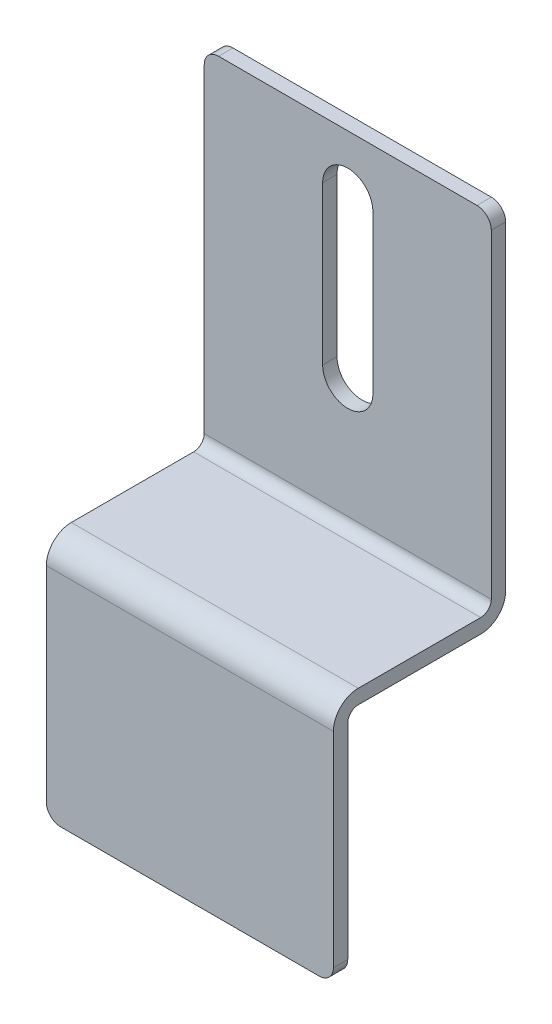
ISO-10303-21;
HEADER;
FILE_DESCRIPTION(('STEP AP214'),'2;1');
FILE_NAME('part.step','',(''),(''),'','','');
FILE_SCHEMA(('AUTOMOTIVE_DESIGN { 1 0 10303 214 1 1 1 1 }'));
ENDSEC;
DATA;
#1=APPLICATION_CONTEXT('core data for automotive mechanical design processes');
#2=APPLICATION_PROTOCOL_DEFINITION('international standard','automotive_design',2000,#1);
#3=PRODUCT_CONTEXT('',#1,'mechanical');
#4=PRODUCT('Part','Part','',(#3));
#5=PRODUCT_RELATED_PRODUCT_CATEGORY('part','',(#4));
#6=PRODUCT_DEFINITION_FORMATION('','',#4);
#7=PRODUCT_DEFINITION_CONTEXT('part definition',#1,'design');
#8=PRODUCT_DEFINITION('design','',#6,#7);
#9=PRODUCT_DEFINITION_SHAPE('','',#8);
#10=(LENGTH_UNIT() NAMED_UNIT(*) SI_UNIT(.MILLI.,.METRE.));
#11=(NAMED_UNIT(*) PLANE_ANGLE_UNIT() SI_UNIT($,.RADIAN.));
#12=(NAMED_UNIT(*) SI_UNIT($,.STERADIAN.) SOLID_ANGLE_UNIT());
#13=UNCERTAINTY_MEASURE_WITH_UNIT(LENGTH_MEASURE(1.E-05),#10,'distance_accuracy_value','');
#14=(GEOMETRIC_REPRESENTATION_CONTEXT(3) GLOBAL_UNCERTAINTY_ASSIGNED_CONTEXT((#13)) GLOBAL_UNIT_ASSIGNED_CONTEXT((#10,
#11,#12)) REPRESENTATION_CONTEXT('',''));
#15=CARTESIAN_POINT('',(0.,0.,0.));
#16=DIRECTION('',(0.,0.,1.));
#17=DIRECTION('',(1.,0.,0.));
#18=AXIS2_PLACEMENT_3D('',#15,#16,#17);
#19=CARTESIAN_POINT('',(20.,-25.,12.));
#20=DIRECTION('',(0.,0.,-1.));
#21=DIRECTION('',(-1.,0.,0.));
#22=AXIS2_PLACEMENT_3D('',#19,#20,#21);
#23=PLANE('',#22);
#24=CARTESIAN_POINT('',(1.,-40.,12.));
#25=DIRECTION('',(0.,0.,1.));
#26=DIRECTION('',(1.,0.,0.));
#27=AXIS2_PLACEMENT_3D('',#24,#25,#26);
#28=CIRCLE('',#27,1.);
#29=CARTESIAN_POINT('',(1.,-41.,12.));
#30=VERTEX_POINT('',#29);
#31=CARTESIAN_POINT('',(0.,-40.,12.));
#32=VERTEX_POINT('',#31);
#33=EDGE_CURVE('E174',#30,#32,#28,.F.);
#34=ORIENTED_EDGE('',*,*,#33,.F.);
#35=DIRECTION('',(1.,0.,0.));
#36=VECTOR('',#35,1.);
#37=CARTESIAN_POINT('',(20.,-41.,12.));
#38=LINE('',#37,#36);
#39=CARTESIAN_POINT('',(19.,-41.,12.));
#40=VERTEX_POINT('',#39);
#41=EDGE_CURVE('E173',#40,#30,#38,.F.);
#42=ORIENTED_EDGE('',*,*,#41,.F.);
#43=CARTESIAN_POINT('',(19.,-40.,12.));
#44=DIRECTION('',(0.,0.,1.));
#45=DIRECTION('',(1.,0.,0.));
#46=AXIS2_PLACEMENT_3D('',#43,#44,#45);
#47=CIRCLE('',#46,1.);
#48=CARTESIAN_POINT('',(20.,-40.,12.));
#49=VERTEX_POINT('',#48);
#50=EDGE_CURVE('E164',#49,#40,#47,.F.);
#51=ORIENTED_EDGE('',*,*,#50,.F.);
#52=DIRECTION('',(0.,1.,0.));
#53=VECTOR('',#52,1.);
#54=CARTESIAN_POINT('',(20.,-24.,12.));
#55=LINE('',#54,#53);
#56=CARTESIAN_POINT('',(20.,-25.7366,12.));
#57=VERTEX_POINT('',#56);
#58=EDGE_CURVE('E233',#57,#49,#55,.F.);
#59=ORIENTED_EDGE('',*,*,#58,.F.);
#60=DIRECTION('',(-1.,0.,0.));
#61=VECTOR('',#60,1.);
#62=CARTESIAN_POINT('',(20.,-25.7366,12.));
#63=LINE('',#62,#61);
#64=CARTESIAN_POINT('',(0.,-25.7366,12.));
#65=VERTEX_POINT('',#64);
#66=EDGE_CURVE('E170',#65,#57,#63,.F.);
#67=ORIENTED_EDGE('',*,*,#66,.F.);
#68=DIRECTION('',(0.,1.,0.));
#69=VECTOR('',#68,1.);
#70=CARTESIAN_POINT('',(0.,-25.7366,12.));
#71=LINE('',#70,#69);
#72=EDGE_CURVE('E230',#32,#65,#71,.T.);
#73=ORIENTED_EDGE('',*,*,#72,.F.);
#74=EDGE_LOOP('',(#34,#42,#51,#59,#67,#73));
#75=FACE_BOUND('',#74,.T.);
#76=ADVANCED_FACE('F16',(#75),#23,.F.);
#77=CARTESIAN_POINT('',(20.,-25.7366,10.2634));
#78=DIRECTION('',(-1.,0.,0.));
#79=DIRECTION('',(0.,0.,1.));
#80=AXIS2_PLACEMENT_3D('',#77,#78,#79);
#81=CYLINDRICAL_SURFACE('',#80,1.7366);
#82=CARTESIAN_POINT('',(20.,-25.7366,10.2634));
#83=DIRECTION('',(-1.,0.,0.));
#84=DIRECTION('',(0.,0.,1.));
#85=AXIS2_PLACEMENT_3D('',#82,#83,#84);
#86=CIRCLE('',#85,1.7366);
#87=CARTESIAN_POINT('',(20.,-24.,10.2634));
#88=VERTEX_POINT('',#87);
#89=EDGE_CURVE('E171',#57,#88,#86,.T.);
#90=ORIENTED_EDGE('',*,*,#89,.T.);
#91=DIRECTION('',(1.,0.,0.));
#92=VECTOR('',#91,1.);
#93=CARTESIAN_POINT('',(20.,-24.,10.2634));
#94=LINE('',#93,#92);
#95=CARTESIAN_POINT('',(0.,-24.,10.2634));
#96=VERTEX_POINT('',#95);
#97=EDGE_CURVE('E246',#88,#96,#94,.F.);
#98=ORIENTED_EDGE('',*,*,#97,.T.);
#99=CARTESIAN_POINT('',(0.,-25.7366,10.2634));
#100=DIRECTION('',(-1.,0.,0.));
#101=DIRECTION('',(0.,0.,1.));
#102=AXIS2_PLACEMENT_3D('',#99,#100,#101);
#103=CIRCLE('',#102,1.7366);
#104=EDGE_CURVE('E165',#96,#65,#103,.F.);
#105=ORIENTED_EDGE('',*,*,#104,.T.);
#106=ORIENTED_EDGE('',*,*,#66,.T.);
#107=EDGE_LOOP('',(#90,#98,#105,#106));
#108=FACE_BOUND('',#107,.T.);
#109=ADVANCED_FACE('F524',(#108),#81,.T.);
#110=CARTESIAN_POINT('',(20.,-41.,11.));
#111=DIRECTION('',(0.,-1.,0.));
#112=DIRECTION('',(0.,0.,-1.));
#113=AXIS2_PLACEMENT_3D('',#110,#111,#112);
#114=PLANE('',#113);
#115=DIRECTION('',(-1.,0.,0.));
#116=VECTOR('',#115,1.);
#117=CARTESIAN_POINT('',(20.,-41.,11.));
#118=LINE('',#117,#116);
#119=CARTESIAN_POINT('',(19.,-41.,11.));
#120=VERTEX_POINT('',#119);
#121=CARTESIAN_POINT('',(1.,-41.,11.));
#122=VERTEX_POINT('',#121);
#123=EDGE_CURVE('E179',#120,#122,#118,.T.);
#124=ORIENTED_EDGE('',*,*,#123,.F.);
#125=DIRECTION('',(0.,0.,1.));
#126=VECTOR('',#125,1.);
#127=CARTESIAN_POINT('',(19.,-41.,11.));
#128=LINE('',#127,#126);
#129=EDGE_CURVE('E243',#40,#120,#128,.F.);
#130=ORIENTED_EDGE('',*,*,#129,.F.);
#131=ORIENTED_EDGE('',*,*,#41,.T.);
#132=DIRECTION('',(0.,0.,1.));
#133=VECTOR('',#132,1.);
#134=CARTESIAN_POINT('',(1.,-41.,10.2634));
#135=LINE('',#134,#133);
#136=EDGE_CURVE('E177',#122,#30,#135,.T.);
#137=ORIENTED_EDGE('',*,*,#136,.F.);
#138=EDGE_LOOP('',(#124,#130,#131,#137));
#139=FACE_BOUND('',#138,.T.);
#140=ADVANCED_FACE('F515',(#139),#114,.T.);
#141=CARTESIAN_POINT('',(1.,-40.,10.2634));
#142=DIRECTION('',(0.,0.,1.));
#143=DIRECTION('',(1.,0.,0.));
#144=AXIS2_PLACEMENT_3D('',#141,#142,#143);
#145=CYLINDRICAL_SURFACE('',#144,1.);
#146=ORIENTED_EDGE('',*,*,#33,.T.);
#147=DIRECTION('',(0.,0.,1.));
#148=VECTOR('',#147,1.);
#149=CARTESIAN_POINT('',(0.,-40.,10.2634));
#150=LINE('',#149,#148);
#151=CARTESIAN_POINT('',(0.,-40.,11.));
#152=VERTEX_POINT('',#151);
#153=EDGE_CURVE('E176',#152,#32,#150,.T.);
#154=ORIENTED_EDGE('',*,*,#153,.F.);
#155=CARTESIAN_POINT('',(1.,-40.,11.));
#156=DIRECTION('',(0.,0.,1.));
#157=DIRECTION('',(1.,0.,0.));
#158=AXIS2_PLACEMENT_3D('',#155,#156,#157);
#159=CIRCLE('',#158,1.);
#160=EDGE_CURVE('E155',#122,#152,#159,.F.);
#161=ORIENTED_EDGE('',*,*,#160,.F.);
#162=ORIENTED_EDGE('',*,*,#136,.T.);
#163=EDGE_LOOP('',(#146,#154,#161,#162));
#164=FACE_BOUND('',#163,.T.);
#165=ADVANCED_FACE('F506',(#164),#145,.T.);
#166=CARTESIAN_POINT('',(19.,-40.,11.));
#167=DIRECTION('',(0.,0.,1.));
#168=DIRECTION('',(1.,0.,0.));
#169=AXIS2_PLACEMENT_3D('',#166,#167,#168);
#170=CYLINDRICAL_SURFACE('',#169,1.);
#171=ORIENTED_EDGE('',*,*,#50,.T.);
#172=ORIENTED_EDGE('',*,*,#129,.T.);
#173=CARTESIAN_POINT('',(19.,-40.,11.));
#174=DIRECTION('',(0.,0.,1.));
#175=DIRECTION('',(1.,0.,0.));
#176=AXIS2_PLACEMENT_3D('',#173,#174,#175);
#177=CIRCLE('',#176,1.);
#178=CARTESIAN_POINT('',(20.,-40.,11.));
#179=VERTEX_POINT('',#178);
#180=EDGE_CURVE('E180',#179,#120,#177,.F.);
#181=ORIENTED_EDGE('',*,*,#180,.F.);
#182=DIRECTION('',(0.,0.,1.));
#183=VECTOR('',#182,1.);
#184=CARTESIAN_POINT('',(20.,-40.,11.));
#185=LINE('',#184,#183);
#186=EDGE_CURVE('E236',#179,#49,#185,.T.);
#187=ORIENTED_EDGE('',*,*,#186,.T.);
#188=EDGE_LOOP('',(#171,#172,#181,#187));
#189=FACE_BOUND('',#188,.T.);
#190=ADVANCED_FACE('F497',(#189),#170,.T.);
#191=CARTESIAN_POINT('',(20.,-24.,0.));
#192=DIRECTION('',(0.,-1.,0.));
#193=DIRECTION('',(0.,0.,-1.));
#194=AXIS2_PLACEMENT_3D('',#191,#192,#193);
#195=PLANE('',#194);
#196=ORIENTED_EDGE('',*,*,#97,.F.);
#197=DIRECTION('',(0.,0.,-1.));
#198=VECTOR('',#197,1.);
#199=CARTESIAN_POINT('',(20.,-24.,0.999999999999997));
#200=LINE('',#199,#198);
#201=CARTESIAN_POINT('',(20.,-24.,1.7366));
#202=VERTEX_POINT('',#201);
#203=EDGE_CURVE('E147',#202,#88,#200,.F.);
#204=ORIENTED_EDGE('',*,*,#203,.F.);
#205=DIRECTION('',(-1.,0.,0.));
#206=VECTOR('',#205,1.);
#207=CARTESIAN_POINT('',(20.,-24.,1.7366));
#208=LINE('',#207,#206);
#209=CARTESIAN_POINT('',(0.,-24.,1.7366));
#210=VERTEX_POINT('',#209);
#211=EDGE_CURVE('E185',#202,#210,#208,.T.);
#212=ORIENTED_EDGE('',*,*,#211,.T.);
#213=DIRECTION('',(0.,0.,1.));
#214=VECTOR('',#213,1.);
#215=CARTESIAN_POINT('',(0.,-24.,12.));
#216=LINE('',#215,#214);
#217=EDGE_CURVE('E188',#96,#210,#216,.F.);
#218=ORIENTED_EDGE('',*,*,#217,.F.);
#219=EDGE_LOOP('',(#196,#204,#212,#218));
#220=FACE_BOUND('',#219,.T.);
#221=ADVANCED_FACE('F489',(#220),#195,.F.);
#222=CARTESIAN_POINT('',(20.,-25.,11.));
#223=DIRECTION('',(0.,0.,-1.));
#224=DIRECTION('',(-1.,0.,0.));
#225=AXIS2_PLACEMENT_3D('',#222,#223,#224);
#226=PLANE('',#225);
#227=DIRECTION('',(0.,1.,0.));
#228=VECTOR('',#227,1.);
#229=CARTESIAN_POINT('',(20.,-25.,11.));
#230=LINE('',#229,#228);
#231=CARTESIAN_POINT('',(20.,-25.7366,11.));
#232=VERTEX_POINT('',#231);
#233=EDGE_CURVE('E158',#232,#179,#230,.F.);
#234=ORIENTED_EDGE('',*,*,#233,.T.);
#235=ORIENTED_EDGE('',*,*,#180,.T.);
#236=ORIENTED_EDGE('',*,*,#123,.T.);
#237=ORIENTED_EDGE('',*,*,#160,.T.);
#238=DIRECTION('',(0.,1.,0.));
#239=VECTOR('',#238,1.);
#240=CARTESIAN_POINT('',(0.,-25.,11.));
#241=LINE('',#240,#239);
#242=CARTESIAN_POINT('',(0.,-25.7366,11.));
#243=VERTEX_POINT('',#242);
#244=EDGE_CURVE('E151',#152,#243,#241,.T.);
#245=ORIENTED_EDGE('',*,*,#244,.T.);
#246=DIRECTION('',(-1.,0.,0.));
#247=VECTOR('',#246,1.);
#248=CARTESIAN_POINT('',(20.,-25.7366,11.));
#249=LINE('',#248,#247);
#250=EDGE_CURVE('E138',#243,#232,#249,.F.);
#251=ORIENTED_EDGE('',*,*,#250,.T.);
#252=EDGE_LOOP('',(#234,#235,#236,#237,#245,#251));
#253=FACE_BOUND('',#252,.T.);
#254=ADVANCED_FACE('F152',(#253),#226,.T.);
#255=CARTESIAN_POINT('',(20.,-23.2634,1.7366));
#256=DIRECTION('',(-1.,0.,0.));
#257=DIRECTION('',(0.,0.,1.));
#258=AXIS2_PLACEMENT_3D('',#255,#256,#257);
#259=CYLINDRICAL_SURFACE('',#258,0.7366);
#260=ORIENTED_EDGE('',*,*,#211,.F.);
#261=CARTESIAN_POINT('',(20.,-23.2634,1.7366));
#262=DIRECTION('',(-1.,0.,0.));
#263=DIRECTION('',(0.,0.,1.));
#264=AXIS2_PLACEMENT_3D('',#261,#262,#263);
#265=CIRCLE('',#264,0.7366);
#266=CARTESIAN_POINT('',(20.,-23.2634,0.999999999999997));
#267=VERTEX_POINT('',#266);
#268=EDGE_CURVE('E183',#267,#202,#265,.T.);
#269=ORIENTED_EDGE('',*,*,#268,.F.);
#270=DIRECTION('',(1.,0.,0.));
#271=VECTOR('',#270,1.);
#272=CARTESIAN_POINT('',(20.,-23.2634,0.999999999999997));
#273=LINE('',#272,#271);
#274=CARTESIAN_POINT('',(0.,-23.2634,0.999999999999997));
#275=VERTEX_POINT('',#274);
#276=EDGE_CURVE('E146',#267,#275,#273,.F.);
#277=ORIENTED_EDGE('',*,*,#276,.T.);
#278=CARTESIAN_POINT('',(0.,-23.2634,1.7366));
#279=DIRECTION('',(-1.,0.,0.));
#280=DIRECTION('',(0.,0.,1.));
#281=AXIS2_PLACEMENT_3D('',#278,#279,#280);
#282=CIRCLE('',#281,0.7366);
#283=EDGE_CURVE('E186',#210,#275,#282,.F.);
#284=ORIENTED_EDGE('',*,*,#283,.F.);
#285=EDGE_LOOP('',(#260,#269,#277,#284));
#286=FACE_BOUND('',#285,.T.);
#287=ADVANCED_FACE('F361',(#286),#259,.F.);
#288=CARTESIAN_POINT('',(20.,-25.7366,10.2634));
#289=DIRECTION('',(-1.,0.,0.));
#290=DIRECTION('',(0.,0.,1.));
#291=AXIS2_PLACEMENT_3D('',#288,#289,#290);
#292=CYLINDRICAL_SURFACE('',#291,0.7366);
#293=DIRECTION('',(1.,0.,0.));
#294=VECTOR('',#293,1.);
#295=CARTESIAN_POINT('',(20.,-25.,10.2634));
#296=LINE('',#295,#294);
#297=CARTESIAN_POINT('',(20.,-25.,10.2634));
#298=VERTEX_POINT('',#297);
#299=CARTESIAN_POINT('',(0.,-25.,10.2634));
#300=VERTEX_POINT('',#299);
#301=EDGE_CURVE('E256',#298,#300,#296,.F.);
#302=ORIENTED_EDGE('',*,*,#301,.F.);
#303=CARTESIAN_POINT('',(20.,-25.7366,10.2634));
#304=DIRECTION('',(-1.,0.,0.));
#305=DIRECTION('',(0.,0.,1.));
#306=AXIS2_PLACEMENT_3D('',#303,#304,#305);
#307=CIRCLE('',#306,0.7366);
#308=EDGE_CURVE('E142',#232,#298,#307,.T.);
#309=ORIENTED_EDGE('',*,*,#308,.F.);
#310=ORIENTED_EDGE('',*,*,#250,.F.);
#311=CARTESIAN_POINT('',(0.,-25.7366,10.2634));
#312=DIRECTION('',(-1.,0.,0.));
#313=DIRECTION('',(0.,0.,1.));
#314=AXIS2_PLACEMENT_3D('',#311,#312,#313);
#315=CIRCLE('',#314,0.7366);
#316=EDGE_CURVE('E19',#300,#243,#315,.F.);
#317=ORIENTED_EDGE('',*,*,#316,.F.);
#318=EDGE_LOOP('',(#302,#309,#310,#317));
#319=FACE_BOUND('',#318,.T.);
#320=ADVANCED_FACE('F140',(#319),#292,.F.);
#321=CARTESIAN_POINT('',(20.,0.,1.));
#322=DIRECTION('',(0.,0.,-1.));
#323=DIRECTION('',(0.,1.,0.));
#324=AXIS2_PLACEMENT_3D('',#321,#322,#323);
#325=PLANE('',#324);
#326=CARTESIAN_POINT('',(1.,-1.,1.));
#327=DIRECTION('',(0.,0.,-1.));
#328=DIRECTION('',(0.,1.,0.));
#329=AXIS2_PLACEMENT_3D('',#326,#327,#328);
#330=CIRCLE('',#329,1.);
#331=CARTESIAN_POINT('',(0.,-1.,0.999999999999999));
#332=VERTEX_POINT('',#331);
#333=CARTESIAN_POINT('',(1.,0.,1.));
#334=VERTEX_POINT('',#333);
#335=EDGE_CURVE('E198',#332,#334,#330,.T.);
#336=ORIENTED_EDGE('',*,*,#335,.F.);
#337=DIRECTION('',(0.,1.,0.));
#338=VECTOR('',#337,1.);
#339=CARTESIAN_POINT('',(0.,-24.,0.999999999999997));
#340=LINE('',#339,#338);
#341=EDGE_CURVE('E196',#275,#332,#340,.T.);
#342=ORIENTED_EDGE('',*,*,#341,.F.);
#343=ORIENTED_EDGE('',*,*,#276,.F.);
#344=DIRECTION('',(0.,1.,0.));
#345=VECTOR('',#344,1.);
#346=CARTESIAN_POINT('',(20.,-25.7366,0.999999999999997));
#347=LINE('',#346,#345);
#348=CARTESIAN_POINT('',(20.,-1.,0.999999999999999));
#349=VERTEX_POINT('',#348);
#350=EDGE_CURVE('E272',#267,#349,#347,.T.);
#351=ORIENTED_EDGE('',*,*,#350,.T.);
#352=CARTESIAN_POINT('',(19.,-1.,1.));
#353=DIRECTION('',(0.,0.,1.));
#354=DIRECTION('',(0.,-1.,0.));
#355=AXIS2_PLACEMENT_3D('',#352,#353,#354);
#356=CIRCLE('',#355,1.);
#357=CARTESIAN_POINT('',(19.,0.,1.));
#358=VERTEX_POINT('',#357);
#359=EDGE_CURVE('E201',#358,#349,#356,.F.);
#360=ORIENTED_EDGE('',*,*,#359,.F.);
#361=DIRECTION('',(1.,0.,0.));
#362=VECTOR('',#361,1.);
#363=CARTESIAN_POINT('',(20.,0.,1.));
#364=LINE('',#363,#362);
#365=EDGE_CURVE('E205',#334,#358,#364,.T.);
#366=ORIENTED_EDGE('',*,*,#365,.F.);
#367=EDGE_LOOP('',(#336,#342,#343,#351,#360,#366));
#368=FACE_BOUND('',#367,.T.);
#369=DIRECTION('',(0.,-1.,0.));
#370=VECTOR('',#369,1.);
#371=CARTESIAN_POINT('',(8.25,-4.,1.));
#372=LINE('',#371,#370);
#373=CARTESIAN_POINT('',(8.24999999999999,-15.,1.));
#374=VERTEX_POINT('',#373);
#375=CARTESIAN_POINT('',(8.25,-4.,1.));
#376=VERTEX_POINT('',#375);
#377=EDGE_CURVE('E258',#374,#376,#372,.F.);
#378=ORIENTED_EDGE('',*,*,#377,.T.);
#379=CARTESIAN_POINT('',(10.,-4.,0.999999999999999));
#380=DIRECTION('',(0.,0.,-1.));
#381=DIRECTION('',(0.,1.,0.));
#382=AXIS2_PLACEMENT_3D('',#379,#380,#381);
#383=CIRCLE('',#382,1.75);
#384=CARTESIAN_POINT('',(11.75,-4.,1.));
#385=VERTEX_POINT('',#384);
#386=EDGE_CURVE('E193',#376,#385,#383,.T.);
#387=ORIENTED_EDGE('',*,*,#386,.T.);
#388=DIRECTION('',(0.,1.,0.));
#389=VECTOR('',#388,1.);
#390=CARTESIAN_POINT('',(11.75,-4.,1.));
#391=LINE('',#390,#389);
#392=CARTESIAN_POINT('',(11.75,-15.,1.));
#393=VERTEX_POINT('',#392);
#394=EDGE_CURVE('E262',#385,#393,#391,.F.);
#395=ORIENTED_EDGE('',*,*,#394,.T.);
#396=CARTESIAN_POINT('',(10.,-15.,0.999999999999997));
#397=DIRECTION('',(0.,0.,-1.));
#398=DIRECTION('',(0.,1.,0.));
#399=AXIS2_PLACEMENT_3D('',#396,#397,#398);
#400=CIRCLE('',#399,1.75000000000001);
#401=EDGE_CURVE('E189',#393,#374,#400,.T.);
#402=ORIENTED_EDGE('',*,*,#401,.T.);
#403=EDGE_LOOP('',(#378,#387,#395,#402));
#404=FACE_BOUND('',#403,.T.);
#405=ADVANCED_FACE('F314',(#368,#404),#325,.F.);
#406=CARTESIAN_POINT('',(20.,-25.,0.));
#407=DIRECTION('',(0.,-1.,0.));
#408=DIRECTION('',(0.,0.,-1.));
#409=AXIS2_PLACEMENT_3D('',#406,#407,#408);
#410=PLANE('',#409);
#411=DIRECTION('',(0.,0.,-1.));
#412=VECTOR('',#411,1.);
#413=CARTESIAN_POINT('',(20.,-25.,0.));
#414=LINE('',#413,#412);
#415=CARTESIAN_POINT('',(20.,-25.,1.7366));
#416=VERTEX_POINT('',#415);
#417=EDGE_CURVE('E259',#416,#298,#414,.F.);
#418=ORIENTED_EDGE('',*,*,#417,.T.);
#419=ORIENTED_EDGE('',*,*,#301,.T.);
#420=DIRECTION('',(0.,0.,-1.));
#421=VECTOR('',#420,1.);
#422=CARTESIAN_POINT('',(0.,-25.,0.));
#423=LINE('',#422,#421);
#424=CARTESIAN_POINT('',(0.,-25.,1.7366));
#425=VERTEX_POINT('',#424);
#426=EDGE_CURVE('E163',#300,#425,#423,.T.);
#427=ORIENTED_EDGE('',*,*,#426,.T.);
#428=DIRECTION('',(-1.,0.,0.));
#429=VECTOR('',#428,1.);
#430=CARTESIAN_POINT('',(20.,-25.,1.7366));
#431=LINE('',#430,#429);
#432=EDGE_CURVE('E211',#416,#425,#431,.T.);
#433=ORIENTED_EDGE('',*,*,#432,.F.);
#434=EDGE_LOOP('',(#418,#419,#427,#433));
#435=FACE_BOUND('',#434,.T.);
#436=ADVANCED_FACE('F352',(#435),#410,.T.);
#437=CARTESIAN_POINT('',(8.25,-4.,12.));
#438=DIRECTION('',(-1.,0.,0.));
#439=DIRECTION('',(0.,-1.,0.));
#440=AXIS2_PLACEMENT_3D('',#437,#438,#439);
#441=PLANE('',#440);
#442=DIRECTION('',(0.,1.,0.));
#443=VECTOR('',#442,1.);
#444=CARTESIAN_POINT('',(8.25,0.,0.));
#445=LINE('',#444,#443);
#446=CARTESIAN_POINT('',(8.25,-4.,0.));
#447=VERTEX_POINT('',#446);
#448=CARTESIAN_POINT('',(8.25,-15.,0.));
#449=VERTEX_POINT('',#448);
#450=EDGE_CURVE('E215',#447,#449,#445,.F.);
#451=ORIENTED_EDGE('',*,*,#450,.F.);
#452=DIRECTION('',(0.,0.,1.));
#453=VECTOR('',#452,1.);
#454=CARTESIAN_POINT('',(8.25,-4.,12.));
#455=LINE('',#454,#453);
#456=EDGE_CURVE('E192',#376,#447,#455,.F.);
#457=ORIENTED_EDGE('',*,*,#456,.F.);
#458=ORIENTED_EDGE('',*,*,#377,.F.);
#459=DIRECTION('',(0.,0.,-1.));
#460=VECTOR('',#459,1.);
#461=CARTESIAN_POINT('',(8.24999999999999,-15.,12.));
#462=LINE('',#461,#460);
#463=EDGE_CURVE('E191',#374,#449,#462,.T.);
#464=ORIENTED_EDGE('',*,*,#463,.T.);
#465=EDGE_LOOP('',(#451,#457,#458,#464));
#466=FACE_BOUND('',#465,.T.);
#467=ADVANCED_FACE('F347',(#466),#441,.F.);
#468=CARTESIAN_POINT('',(10.,-15.,12.));
#469=DIRECTION('',(0.,0.,-1.));
#470=DIRECTION('',(0.,1.,0.));
#471=AXIS2_PLACEMENT_3D('',#468,#469,#470);
#472=CYLINDRICAL_SURFACE('',#471,1.75000000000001);
#473=CARTESIAN_POINT('',(10.,-15.,0.));
#474=DIRECTION('',(0.,0.,-1.));
#475=DIRECTION('',(0.,1.,0.));
#476=AXIS2_PLACEMENT_3D('',#473,#474,#475);
#477=CIRCLE('',#476,1.75000000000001);
#478=CARTESIAN_POINT('',(11.75,-15.,0.));
#479=VERTEX_POINT('',#478);
#480=EDGE_CURVE('E216',#449,#479,#477,.F.);
#481=ORIENTED_EDGE('',*,*,#480,.F.);
#482=ORIENTED_EDGE('',*,*,#463,.F.);
#483=ORIENTED_EDGE('',*,*,#401,.F.);
#484=DIRECTION('',(0.,0.,1.));
#485=VECTOR('',#484,1.);
#486=CARTESIAN_POINT('',(11.75,-15.,12.));
#487=LINE('',#486,#485);
#488=EDGE_CURVE('E264',#393,#479,#487,.F.);
#489=ORIENTED_EDGE('',*,*,#488,.T.);
#490=EDGE_LOOP('',(#481,#482,#483,#489));
#491=FACE_BOUND('',#490,.T.);
#492=ADVANCED_FACE('F339',(#491),#472,.F.);
#493=CARTESIAN_POINT('',(11.75,-4.,12.));
#494=DIRECTION('',(1.,0.,0.));
#495=DIRECTION('',(0.,1.,0.));
#496=AXIS2_PLACEMENT_3D('',#493,#494,#495);
#497=PLANE('',#496);
#498=DIRECTION('',(0.,1.,0.));
#499=VECTOR('',#498,1.);
#500=CARTESIAN_POINT('',(11.75,0.,0.));
#501=LINE('',#500,#499);
#502=CARTESIAN_POINT('',(11.75,-4.,0.));
#503=VERTEX_POINT('',#502);
#504=EDGE_CURVE('E219',#479,#503,#501,.T.);
#505=ORIENTED_EDGE('',*,*,#504,.F.);
#506=ORIENTED_EDGE('',*,*,#488,.F.);
#507=ORIENTED_EDGE('',*,*,#394,.F.);
#508=DIRECTION('',(0.,0.,-1.));
#509=VECTOR('',#508,1.);
#510=CARTESIAN_POINT('',(11.75,-4.,12.));
#511=LINE('',#510,#509);
#512=EDGE_CURVE('E197',#385,#503,#511,.T.);
#513=ORIENTED_EDGE('',*,*,#512,.T.);
#514=EDGE_LOOP('',(#505,#506,#507,#513));
#515=FACE_BOUND('',#514,.T.);
#516=ADVANCED_FACE('F342',(#515),#497,.F.);
#517=CARTESIAN_POINT('',(10.,-4.,12.));
#518=DIRECTION('',(0.,0.,-1.));
#519=DIRECTION('',(0.,1.,0.));
#520=AXIS2_PLACEMENT_3D('',#517,#518,#519);
#521=CYLINDRICAL_SURFACE('',#520,1.75);
#522=ORIENTED_EDGE('',*,*,#386,.F.);
#523=ORIENTED_EDGE('',*,*,#456,.T.);
#524=CARTESIAN_POINT('',(10.,-4.,0.));
#525=DIRECTION('',(0.,0.,-1.));
#526=DIRECTION('',(0.,1.,0.));
#527=AXIS2_PLACEMENT_3D('',#524,#525,#526);
#528=CIRCLE('',#527,1.75);
#529=EDGE_CURVE('E212',#503,#447,#528,.F.);
#530=ORIENTED_EDGE('',*,*,#529,.F.);
#531=ORIENTED_EDGE('',*,*,#512,.F.);
#532=EDGE_LOOP('',(#522,#523,#530,#531));
#533=FACE_BOUND('',#532,.T.);
#534=ADVANCED_FACE('F350',(#533),#521,.F.);
#535=CARTESIAN_POINT('',(0.,-24.,1.7366));
#536=DIRECTION('',(-1.,0.,0.));
#537=DIRECTION('',(0.,0.,1.));
#538=AXIS2_PLACEMENT_3D('',#535,#536,#537);
#539=PLANE('',#538);
#540=DIRECTION('',(0.,1.,0.));
#541=VECTOR('',#540,1.);
#542=CARTESIAN_POINT('',(0.,0.,0.));
#543=LINE('',#542,#541);
#544=CARTESIAN_POINT('',(0.,-23.2634,0.));
#545=VERTEX_POINT('',#544);
#546=CARTESIAN_POINT('',(0.,-1.,0.));
#547=VERTEX_POINT('',#546);
#548=EDGE_CURVE('E224',#545,#547,#543,.T.);
#549=ORIENTED_EDGE('',*,*,#548,.F.);
#550=CARTESIAN_POINT('',(0.,-23.2634,1.7366));
#551=DIRECTION('',(-1.,0.,0.));
#552=DIRECTION('',(0.,0.,1.));
#553=AXIS2_PLACEMENT_3D('',#550,#551,#552);
#554=CIRCLE('',#553,1.7366);
#555=EDGE_CURVE('E206',#425,#545,#554,.F.);
#556=ORIENTED_EDGE('',*,*,#555,.F.);
#557=ORIENTED_EDGE('',*,*,#426,.F.);
#558=ORIENTED_EDGE('',*,*,#316,.T.);
#559=ORIENTED_EDGE('',*,*,#244,.F.);
#560=ORIENTED_EDGE('',*,*,#153,.T.);
#561=ORIENTED_EDGE('',*,*,#72,.T.);
#562=ORIENTED_EDGE('',*,*,#104,.F.);
#563=ORIENTED_EDGE('',*,*,#217,.T.);
#564=ORIENTED_EDGE('',*,*,#283,.T.);
#565=ORIENTED_EDGE('',*,*,#341,.T.);
#566=DIRECTION('',(0.,0.,-1.));
#567=VECTOR('',#566,1.);
#568=CARTESIAN_POINT('',(0.,-1.,1.7366));
#569=LINE('',#568,#567);
#570=EDGE_CURVE('E200',#547,#332,#569,.F.);
#571=ORIENTED_EDGE('',*,*,#570,.F.);
#572=EDGE_LOOP('',(#549,#556,#557,#558,#559,#560,#561,#562,#563,#564,#565,#571));
#573=FACE_BOUND('',#572,.T.);
#574=ADVANCED_FACE('F161',(#573),#539,.T.);
#575=CARTESIAN_POINT('',(1.,-1.,1.7366));
#576=DIRECTION('',(0.,0.,-1.));
#577=DIRECTION('',(0.,1.,0.));
#578=AXIS2_PLACEMENT_3D('',#575,#576,#577);
#579=CYLINDRICAL_SURFACE('',#578,1.);
#580=CARTESIAN_POINT('',(1.,-1.,0.));
#581=DIRECTION('',(0.,0.,-1.));
#582=DIRECTION('',(0.,1.,0.));
#583=AXIS2_PLACEMENT_3D('',#580,#581,#582);
#584=CIRCLE('',#583,1.);
#585=CARTESIAN_POINT('',(1.,0.,0.));
#586=VERTEX_POINT('',#585);
#587=EDGE_CURVE('E220',#547,#586,#584,.T.);
#588=ORIENTED_EDGE('',*,*,#587,.F.);
#589=ORIENTED_EDGE('',*,*,#570,.T.);
#590=ORIENTED_EDGE('',*,*,#335,.T.);
#591=DIRECTION('',(0.,0.,1.));
#592=VECTOR('',#591,1.);
#593=CARTESIAN_POINT('',(1.,0.,1.));
#594=LINE('',#593,#592);
#595=EDGE_CURVE('E269',#586,#334,#594,.T.);
#596=ORIENTED_EDGE('',*,*,#595,.F.);
#597=EDGE_LOOP('',(#588,#589,#590,#596));
#598=FACE_BOUND('',#597,.T.);
#599=ADVANCED_FACE('F324',(#598),#579,.T.);
#600=CARTESIAN_POINT('',(20.,0.,1.));
#601=DIRECTION('',(0.,1.,0.));
#602=DIRECTION('',(0.,0.,1.));
#603=AXIS2_PLACEMENT_3D('',#600,#601,#602);
#604=PLANE('',#603);
#605=ORIENTED_EDGE('',*,*,#365,.T.);
#606=DIRECTION('',(0.,0.,1.));
#607=VECTOR('',#606,1.);
#608=CARTESIAN_POINT('',(19.,0.,1.));
#609=LINE('',#608,#607);
#610=CARTESIAN_POINT('',(19.,0.,0.));
#611=VERTEX_POINT('',#610);
#612=EDGE_CURVE('E204',#611,#358,#609,.T.);
#613=ORIENTED_EDGE('',*,*,#612,.F.);
#614=DIRECTION('',(1.,0.,0.));
#615=VECTOR('',#614,1.);
#616=CARTESIAN_POINT('',(20.,0.,0.));
#617=LINE('',#616,#615);
#618=EDGE_CURVE('E223',#586,#611,#617,.T.);
#619=ORIENTED_EDGE('',*,*,#618,.F.);
#620=ORIENTED_EDGE('',*,*,#595,.T.);
#621=EDGE_LOOP('',(#605,#613,#619,#620));
#622=FACE_BOUND('',#621,.T.);
#623=ADVANCED_FACE('F318',(#622),#604,.T.);
#624=CARTESIAN_POINT('',(19.,-1.,1.));
#625=DIRECTION('',(0.,0.,1.));
#626=DIRECTION('',(0.,-1.,0.));
#627=AXIS2_PLACEMENT_3D('',#624,#625,#626);
#628=CYLINDRICAL_SURFACE('',#627,1.);
#629=CARTESIAN_POINT('',(19.,-1.,0.));
#630=DIRECTION('',(0.,0.,1.));
#631=DIRECTION('',(0.,-1.,0.));
#632=AXIS2_PLACEMENT_3D('',#629,#630,#631);
#633=CIRCLE('',#632,1.);
#634=CARTESIAN_POINT('',(20.,-1.,0.));
#635=VERTEX_POINT('',#634);
#636=EDGE_CURVE('E225',#611,#635,#633,.F.);
#637=ORIENTED_EDGE('',*,*,#636,.F.);
#638=ORIENTED_EDGE('',*,*,#612,.T.);
#639=ORIENTED_EDGE('',*,*,#359,.T.);
#640=DIRECTION('',(0.,0.,1.));
#641=VECTOR('',#640,1.);
#642=CARTESIAN_POINT('',(20.,-1.,10.2634));
#643=LINE('',#642,#641);
#644=EDGE_CURVE('E209',#349,#635,#643,.F.);
#645=ORIENTED_EDGE('',*,*,#644,.T.);
#646=EDGE_LOOP('',(#637,#638,#639,#645));
#647=FACE_BOUND('',#646,.T.);
#648=ADVANCED_FACE('F310',(#647),#628,.T.);
#649=CARTESIAN_POINT('',(20.,-25.7366,10.2634));
#650=DIRECTION('',(-1.,0.,0.));
#651=DIRECTION('',(0.,0.,1.));
#652=AXIS2_PLACEMENT_3D('',#649,#650,#651);
#653=PLANE('',#652);
#654=ORIENTED_EDGE('',*,*,#644,.F.);
#655=ORIENTED_EDGE('',*,*,#350,.F.);
#656=ORIENTED_EDGE('',*,*,#268,.T.);
#657=ORIENTED_EDGE('',*,*,#203,.T.);
#658=ORIENTED_EDGE('',*,*,#89,.F.);
#659=ORIENTED_EDGE('',*,*,#58,.T.);
#660=ORIENTED_EDGE('',*,*,#186,.F.);
#661=ORIENTED_EDGE('',*,*,#233,.F.);
#662=ORIENTED_EDGE('',*,*,#308,.T.);
#663=ORIENTED_EDGE('',*,*,#417,.F.);
#664=CARTESIAN_POINT('',(20.,-23.2634,1.7366));
#665=DIRECTION('',(-1.,0.,0.));
#666=DIRECTION('',(0.,0.,1.));
#667=AXIS2_PLACEMENT_3D('',#664,#665,#666);
#668=CIRCLE('',#667,1.7366);
#669=CARTESIAN_POINT('',(20.,-23.2634,0.));
#670=VERTEX_POINT('',#669);
#671=EDGE_CURVE('E34',#670,#416,#668,.T.);
#672=ORIENTED_EDGE('',*,*,#671,.F.);
#673=DIRECTION('',(0.,1.,0.));
#674=VECTOR('',#673,1.);
#675=CARTESIAN_POINT('',(20.,0.,0.));
#676=LINE('',#675,#674);
#677=EDGE_CURVE('E25',#635,#670,#676,.F.);
#678=ORIENTED_EDGE('',*,*,#677,.F.);
#679=EDGE_LOOP('',(#654,#655,#656,#657,#658,#659,#660,#661,#662,#663,#672,#678));
#680=FACE_BOUND('',#679,.T.);
#681=ADVANCED_FACE('F307',(#680),#653,.F.);
#682=CARTESIAN_POINT('',(20.,-23.2634,1.7366));
#683=DIRECTION('',(-1.,0.,0.));
#684=DIRECTION('',(0.,0.,1.));
#685=AXIS2_PLACEMENT_3D('',#682,#683,#684);
#686=CYLINDRICAL_SURFACE('',#685,1.7366);
#687=ORIENTED_EDGE('',*,*,#671,.T.);
#688=ORIENTED_EDGE('',*,*,#432,.T.);
#689=ORIENTED_EDGE('',*,*,#555,.T.);
#690=DIRECTION('',(1.,0.,0.));
#691=VECTOR('',#690,1.);
#692=CARTESIAN_POINT('',(20.,-23.2634,0.));
#693=LINE('',#692,#691);
#694=EDGE_CURVE('E11',#670,#545,#693,.F.);
#695=ORIENTED_EDGE('',*,*,#694,.F.);
#696=EDGE_LOOP('',(#687,#688,#689,#695));
#697=FACE_BOUND('',#696,.T.);
#698=ADVANCED_FACE('F364',(#697),#686,.T.);
#699=CARTESIAN_POINT('',(20.,0.,0.));
#700=DIRECTION('',(0.,0.,-1.));
#701=DIRECTION('',(0.,1.,0.));
#702=AXIS2_PLACEMENT_3D('',#699,#700,#701);
#703=PLANE('',#702);
#704=ORIENTED_EDGE('',*,*,#677,.T.);
#705=ORIENTED_EDGE('',*,*,#694,.T.);
#706=ORIENTED_EDGE('',*,*,#548,.T.);
#707=ORIENTED_EDGE('',*,*,#587,.T.);
#708=ORIENTED_EDGE('',*,*,#618,.T.);
#709=ORIENTED_EDGE('',*,*,#636,.T.);
#710=EDGE_LOOP('',(#704,#705,#706,#707,#708,#709));
#711=FACE_BOUND('',#710,.T.);
#712=ORIENTED_EDGE('',*,*,#504,.T.);
#713=ORIENTED_EDGE('',*,*,#529,.T.);
#714=ORIENTED_EDGE('',*,*,#450,.T.);
#715=ORIENTED_EDGE('',*,*,#480,.T.);
#716=EDGE_LOOP('',(#712,#713,#714,#715));
#717=FACE_BOUND('',#716,.T.);
#718=ADVANCED_FACE('F303',(#711,#717),#703,.T.);
#719=CLOSED_SHELL('',(#76,#109,#140,#165,#190,#221,#254,#287,#320,#405,#436,#467,#492,#516,#534,
#574,#599,#623,#648,#681,#698,#718));
#720=MANIFOLD_SOLID_BREP('B1',#719);
#721=ADVANCED_BREP_SHAPE_REPRESENTATION('',(#18,#720),#14);
#722=SHAPE_DEFINITION_REPRESENTATION(#9,#721);
ENDSEC;
END-ISO-10303-21;
